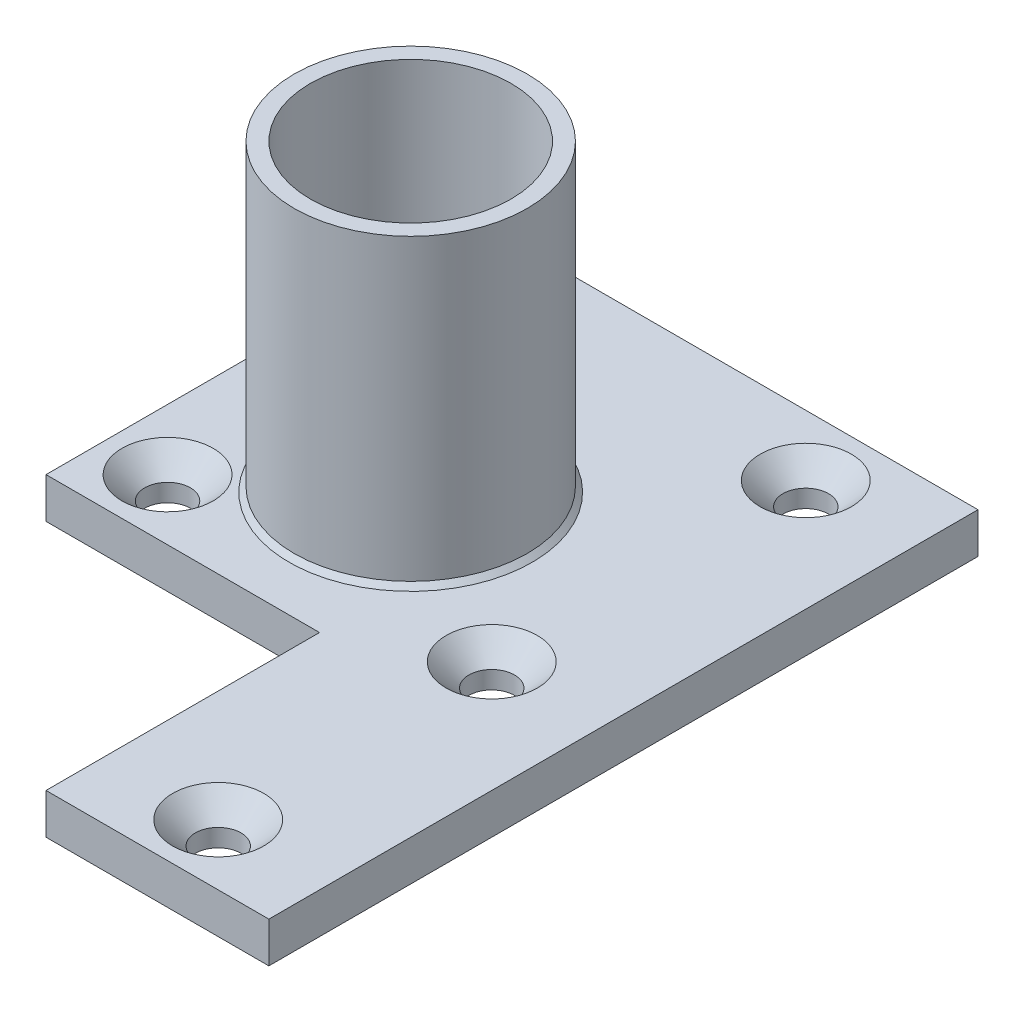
ISO-10303-21;
HEADER;
FILE_DESCRIPTION(('STEP AP214'),'2;1');
FILE_NAME('part.step','',(''),(''),'','','');
FILE_SCHEMA(('AUTOMOTIVE_DESIGN { 1 0 10303 214 1 1 1 1 }'));
ENDSEC;
DATA;
#1=APPLICATION_CONTEXT('core data for automotive mechanical design processes');
#2=APPLICATION_PROTOCOL_DEFINITION('international standard','automotive_design',2000,#1);
#3=PRODUCT_CONTEXT('',#1,'mechanical');
#4=PRODUCT('Part','Part','',(#3));
#5=PRODUCT_RELATED_PRODUCT_CATEGORY('part','',(#4));
#6=PRODUCT_DEFINITION_FORMATION('','',#4);
#7=PRODUCT_DEFINITION_CONTEXT('part definition',#1,'design');
#8=PRODUCT_DEFINITION('design','',#6,#7);
#9=PRODUCT_DEFINITION_SHAPE('','',#8);
#10=(LENGTH_UNIT() NAMED_UNIT(*) SI_UNIT(.MILLI.,.METRE.));
#11=(NAMED_UNIT(*) PLANE_ANGLE_UNIT() SI_UNIT($,.RADIAN.));
#12=(NAMED_UNIT(*) SI_UNIT($,.STERADIAN.) SOLID_ANGLE_UNIT());
#13=UNCERTAINTY_MEASURE_WITH_UNIT(LENGTH_MEASURE(1.E-05),#10,'distance_accuracy_value','');
#14=(GEOMETRIC_REPRESENTATION_CONTEXT(3) GLOBAL_UNCERTAINTY_ASSIGNED_CONTEXT((#13)) GLOBAL_UNIT_ASSIGNED_CONTEXT((#10,
#11,#12)) REPRESENTATION_CONTEXT('',''));
#15=CARTESIAN_POINT('',(0.,0.,0.));
#16=DIRECTION('',(0.,0.,1.));
#17=DIRECTION('',(1.,0.,0.));
#18=AXIS2_PLACEMENT_3D('',#15,#16,#17);
#19=CARTESIAN_POINT('',(-60.8412773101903,34.,-26.5));
#20=DIRECTION('',(0.,-1.,0.));
#21=DIRECTION('',(0.,0.,-1.));
#22=AXIS2_PLACEMENT_3D('',#19,#20,#21);
#23=PLANE('',#22);
#24=CARTESIAN_POINT('',(0.,34.,0.));
#25=DIRECTION('',(0.,-1.,0.));
#26=DIRECTION('',(0.,0.,-1.));
#27=AXIS2_PLACEMENT_3D('',#24,#25,#26);
#28=CIRCLE('',#27,11.5);
#29=CARTESIAN_POINT('',(0.,34.,-11.5));
#30=VERTEX_POINT('',#29);
#31=EDGE_CURVE('E20',#30,#30,#28,.T.);
#32=ORIENTED_EDGE('',*,*,#31,.F.);
#33=EDGE_LOOP('',(#32));
#34=FACE_BOUND('',#33,.T.);
#35=CARTESIAN_POINT('',(0.,34.,0.));
#36=DIRECTION('',(0.,1.,0.));
#37=DIRECTION('',(0.,0.,1.));
#38=AXIS2_PLACEMENT_3D('',#35,#36,#37);
#39=CIRCLE('',#38,9.9);
#40=CARTESIAN_POINT('',(0.,34.,9.9));
#41=VERTEX_POINT('',#40);
#42=EDGE_CURVE('E116',#41,#41,#39,.F.);
#43=ORIENTED_EDGE('',*,*,#42,.T.);
#44=EDGE_LOOP('',(#43));
#45=FACE_BOUND('',#44,.T.);
#46=ADVANCED_FACE('F17',(#34,#45),#23,.F.);
#47=CARTESIAN_POINT('',(0.,66.5269119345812,0.));
#48=DIRECTION('',(0.,-1.,0.));
#49=DIRECTION('',(0.,0.,-1.));
#50=AXIS2_PLACEMENT_3D('',#47,#48,#49);
#51=CYLINDRICAL_SURFACE('',#50,11.5);
#52=ORIENTED_EDGE('',*,*,#31,.T.);
#53=EDGE_LOOP('',(#52));
#54=FACE_BOUND('',#53,.T.);
#55=CARTESIAN_POINT('',(0.,4.5,0.));
#56=DIRECTION('',(0.,-1.,0.));
#57=DIRECTION('',(0.,0.,-1.));
#58=AXIS2_PLACEMENT_3D('',#55,#56,#57);
#59=CIRCLE('',#58,11.5);
#60=CARTESIAN_POINT('',(0.,4.5,-11.5));
#61=VERTEX_POINT('',#60);
#62=EDGE_CURVE('E112',#61,#61,#59,.T.);
#63=ORIENTED_EDGE('',*,*,#62,.F.);
#64=EDGE_LOOP('',(#63));
#65=FACE_BOUND('',#64,.T.);
#66=ADVANCED_FACE('F163',(#54,#65),#51,.T.);
#67=CARTESIAN_POINT('',(0.,-24.0014285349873,0.));
#68=DIRECTION('',(0.,1.,0.));
#69=DIRECTION('',(0.,0.,1.));
#70=AXIS2_PLACEMENT_3D('',#67,#68,#69);
#71=CYLINDRICAL_SURFACE('',#70,9.9);
#72=CARTESIAN_POINT('',(0.,4.,0.));
#73=DIRECTION('',(0.,1.,0.));
#74=DIRECTION('',(0.,0.,1.));
#75=AXIS2_PLACEMENT_3D('',#72,#73,#74);
#76=CIRCLE('',#75,9.9);
#77=CARTESIAN_POINT('',(0.,4.,9.9));
#78=VERTEX_POINT('',#77);
#79=EDGE_CURVE('E115',#78,#78,#76,.T.);
#80=ORIENTED_EDGE('',*,*,#79,.F.);
#81=EDGE_LOOP('',(#80));
#82=FACE_BOUND('',#81,.T.);
#83=ORIENTED_EDGE('',*,*,#42,.F.);
#84=EDGE_LOOP('',(#83));
#85=FACE_BOUND('',#84,.T.);
#86=ADVANCED_FACE('F171',(#82,#85),#71,.F.);
#87=CARTESIAN_POINT('',(0.,4.,0.));
#88=DIRECTION('',(0.,-1.,0.));
#89=DIRECTION('',(0.,0.,-1.));
#90=AXIS2_PLACEMENT_3D('',#87,#88,#89);
#91=CONICAL_SURFACE('',#90,12.,0.78539816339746);
#92=ORIENTED_EDGE('',*,*,#62,.T.);
#93=EDGE_LOOP('',(#92));
#94=FACE_BOUND('',#93,.T.);
#95=CARTESIAN_POINT('',(0.,4.,0.));
#96=DIRECTION('',(0.,-1.,0.));
#97=DIRECTION('',(0.,0.,-1.));
#98=AXIS2_PLACEMENT_3D('',#95,#96,#97);
#99=CIRCLE('',#98,12.);
#100=CARTESIAN_POINT('',(0.,4.,-12.));
#101=VERTEX_POINT('',#100);
#102=EDGE_CURVE('E153',#101,#101,#99,.T.);
#103=ORIENTED_EDGE('',*,*,#102,.F.);
#104=EDGE_LOOP('',(#103));
#105=FACE_BOUND('',#104,.T.);
#106=ADVANCED_FACE('F249',(#94,#105),#91,.T.);
#107=CARTESIAN_POINT('',(0.,4.,0.));
#108=DIRECTION('',(0.,1.,0.));
#109=DIRECTION('',(0.,0.,1.));
#110=AXIS2_PLACEMENT_3D('',#107,#108,#109);
#111=PLANE('',#110);
#112=ORIENTED_EDGE('',*,*,#79,.T.);
#113=EDGE_LOOP('',(#112));
#114=FACE_BOUND('',#113,.T.);
#115=CARTESIAN_POINT('',(0.,4.,0.));
#116=DIRECTION('',(0.,1.,0.));
#117=DIRECTION('',(0.,0.,1.));
#118=AXIS2_PLACEMENT_3D('',#115,#116,#117);
#119=CIRCLE('',#118,8.5);
#120=CARTESIAN_POINT('',(0.,4.,8.5));
#121=VERTEX_POINT('',#120);
#122=EDGE_CURVE('E111',#121,#121,#119,.F.);
#123=ORIENTED_EDGE('',*,*,#122,.T.);
#124=EDGE_LOOP('',(#123));
#125=FACE_BOUND('',#124,.T.);
#126=ADVANCED_FACE('F245',(#114,#125),#111,.T.);
#127=CARTESIAN_POINT('',(-13.5,4.0000000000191,-20.5));
#128=DIRECTION('',(0.,1.,0.));
#129=DIRECTION('',(0.,0.,1.));
#130=AXIS2_PLACEMENT_3D('',#127,#128,#129);
#131=CONICAL_SURFACE('',#130,4.49999999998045,0.785398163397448);
#132=CARTESIAN_POINT('',(-13.5,1.75,-20.5));
#133=DIRECTION('',(0.,1.,0.));
#134=DIRECTION('',(0.,0.,1.));
#135=AXIS2_PLACEMENT_3D('',#132,#133,#134);
#136=CIRCLE('',#135,2.25);
#137=CARTESIAN_POINT('',(-13.5,1.75,-18.25));
#138=VERTEX_POINT('',#137);
#139=EDGE_CURVE('E108',#138,#138,#136,.F.);
#140=ORIENTED_EDGE('',*,*,#139,.T.);
#141=EDGE_LOOP('',(#140));
#142=FACE_BOUND('',#141,.T.);
#143=CARTESIAN_POINT('',(-13.5,4.0000000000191,-20.5));
#144=DIRECTION('',(0.,1.,0.));
#145=DIRECTION('',(0.,0.,1.));
#146=AXIS2_PLACEMENT_3D('',#143,#144,#145);
#147=CIRCLE('',#146,4.49999999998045);
#148=CARTESIAN_POINT('',(-13.5,4.0000000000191,-16.0000000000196));
#149=VERTEX_POINT('',#148);
#150=EDGE_CURVE('E138',#149,#149,#147,.F.);
#151=ORIENTED_EDGE('',*,*,#150,.F.);
#152=EDGE_LOOP('',(#151));
#153=FACE_BOUND('',#152,.T.);
#154=ADVANCED_FACE('F241',(#142,#153),#131,.F.);
#155=CARTESIAN_POINT('',(18.5,4.0000000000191,-20.5));
#156=DIRECTION('',(0.,1.,0.));
#157=DIRECTION('',(0.,0.,1.));
#158=AXIS2_PLACEMENT_3D('',#155,#156,#157);
#159=CONICAL_SURFACE('',#158,4.49999999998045,0.785398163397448);
#160=CARTESIAN_POINT('',(18.5,1.75,-20.5));
#161=DIRECTION('',(0.,1.,0.));
#162=DIRECTION('',(0.,0.,1.));
#163=AXIS2_PLACEMENT_3D('',#160,#161,#162);
#164=CIRCLE('',#163,2.25);
#165=CARTESIAN_POINT('',(18.5,1.75,-18.25));
#166=VERTEX_POINT('',#165);
#167=EDGE_CURVE('E105',#166,#166,#164,.F.);
#168=ORIENTED_EDGE('',*,*,#167,.T.);
#169=EDGE_LOOP('',(#168));
#170=FACE_BOUND('',#169,.T.);
#171=CARTESIAN_POINT('',(18.5,4.0000000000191,-20.5));
#172=DIRECTION('',(0.,1.,0.));
#173=DIRECTION('',(0.,0.,1.));
#174=AXIS2_PLACEMENT_3D('',#171,#172,#173);
#175=CIRCLE('',#174,4.49999999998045);
#176=CARTESIAN_POINT('',(18.5,4.0000000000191,-16.0000000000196));
#177=VERTEX_POINT('',#176);
#178=EDGE_CURVE('E141',#177,#177,#175,.F.);
#179=ORIENTED_EDGE('',*,*,#178,.F.);
#180=EDGE_LOOP('',(#179));
#181=FACE_BOUND('',#180,.T.);
#182=ADVANCED_FACE('F237',(#170,#181),#159,.F.);
#183=CARTESIAN_POINT('',(18.5,4.0000000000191,10.5));
#184=DIRECTION('',(0.,1.,0.));
#185=DIRECTION('',(0.,0.,1.));
#186=AXIS2_PLACEMENT_3D('',#183,#184,#185);
#187=CONICAL_SURFACE('',#186,4.49999999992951,0.785398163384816);
#188=CARTESIAN_POINT('',(18.5,1.75,10.5));
#189=DIRECTION('',(0.,1.,0.));
#190=DIRECTION('',(0.,0.,1.));
#191=AXIS2_PLACEMENT_3D('',#188,#189,#190);
#192=CIRCLE('',#191,2.24999999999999);
#193=CARTESIAN_POINT('',(18.5,1.75,12.75));
#194=VERTEX_POINT('',#193);
#195=EDGE_CURVE('E102',#194,#194,#192,.F.);
#196=ORIENTED_EDGE('',*,*,#195,.T.);
#197=EDGE_LOOP('',(#196));
#198=FACE_BOUND('',#197,.T.);
#199=CARTESIAN_POINT('',(18.5,4.0000000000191,10.5));
#200=DIRECTION('',(0.,1.,0.));
#201=DIRECTION('',(0.,0.,1.));
#202=AXIS2_PLACEMENT_3D('',#199,#200,#201);
#203=CIRCLE('',#202,4.49999999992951);
#204=CARTESIAN_POINT('',(18.5,4.0000000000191,14.9999999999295));
#205=VERTEX_POINT('',#204);
#206=EDGE_CURVE('E144',#205,#205,#203,.F.);
#207=ORIENTED_EDGE('',*,*,#206,.F.);
#208=EDGE_LOOP('',(#207));
#209=FACE_BOUND('',#208,.T.);
#210=ADVANCED_FACE('F233',(#198,#209),#187,.F.);
#211=CARTESIAN_POINT('',(18.5,3.99999999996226,37.5));
#212=DIRECTION('',(0.,1.,0.));
#213=DIRECTION('',(0.,0.,1.));
#214=AXIS2_PLACEMENT_3D('',#211,#212,#213);
#215=CONICAL_SURFACE('',#214,4.49999999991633,0.785398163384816);
#216=CARTESIAN_POINT('',(18.5,1.75,37.5));
#217=DIRECTION('',(0.,1.,0.));
#218=DIRECTION('',(0.,0.,1.));
#219=AXIS2_PLACEMENT_3D('',#216,#217,#218);
#220=CIRCLE('',#219,2.25);
#221=CARTESIAN_POINT('',(18.5,1.75,39.75));
#222=VERTEX_POINT('',#221);
#223=EDGE_CURVE('E99',#222,#222,#220,.F.);
#224=ORIENTED_EDGE('',*,*,#223,.T.);
#225=EDGE_LOOP('',(#224));
#226=FACE_BOUND('',#225,.T.);
#227=CARTESIAN_POINT('',(18.5,4.0000000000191,37.5));
#228=DIRECTION('',(0.,1.,0.));
#229=DIRECTION('',(0.,0.,1.));
#230=AXIS2_PLACEMENT_3D('',#227,#228,#229);
#231=CIRCLE('',#230,4.49999999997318);
#232=CARTESIAN_POINT('',(18.5,4.0000000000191,41.9999999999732));
#233=VERTEX_POINT('',#232);
#234=EDGE_CURVE('E147',#233,#233,#231,.F.);
#235=ORIENTED_EDGE('',*,*,#234,.F.);
#236=EDGE_LOOP('',(#235));
#237=FACE_BOUND('',#236,.T.);
#238=ADVANCED_FACE('F229',(#226,#237),#215,.F.);
#239=CARTESIAN_POINT('',(-13.5,4.0000000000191,10.5));
#240=DIRECTION('',(0.,1.,0.));
#241=DIRECTION('',(0.,0.,1.));
#242=AXIS2_PLACEMENT_3D('',#239,#240,#241);
#243=CONICAL_SURFACE('',#242,4.49999999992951,0.785398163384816);
#244=CARTESIAN_POINT('',(-13.5,1.75,10.5));
#245=DIRECTION('',(0.,1.,0.));
#246=DIRECTION('',(0.,0.,1.));
#247=AXIS2_PLACEMENT_3D('',#244,#245,#246);
#248=CIRCLE('',#247,2.24999999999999);
#249=CARTESIAN_POINT('',(-13.5,1.75,12.75));
#250=VERTEX_POINT('',#249);
#251=EDGE_CURVE('E83',#250,#250,#248,.F.);
#252=ORIENTED_EDGE('',*,*,#251,.T.);
#253=EDGE_LOOP('',(#252));
#254=FACE_BOUND('',#253,.T.);
#255=CARTESIAN_POINT('',(-13.5,4.0000000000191,10.5));
#256=DIRECTION('',(0.,1.,0.));
#257=DIRECTION('',(0.,0.,1.));
#258=AXIS2_PLACEMENT_3D('',#255,#256,#257);
#259=CIRCLE('',#258,4.49999999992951);
#260=CARTESIAN_POINT('',(-13.5,4.0000000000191,14.9999999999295));
#261=VERTEX_POINT('',#260);
#262=EDGE_CURVE('E150',#261,#261,#259,.F.);
#263=ORIENTED_EDGE('',*,*,#262,.F.);
#264=EDGE_LOOP('',(#263));
#265=FACE_BOUND('',#264,.T.);
#266=ADVANCED_FACE('F225',(#254,#265),#243,.F.);
#267=CARTESIAN_POINT('',(0.,4.,0.));
#268=DIRECTION('',(0.,1.,0.));
#269=DIRECTION('',(0.,0.,1.));
#270=AXIS2_PLACEMENT_3D('',#267,#268,#269);
#271=PLANE('',#270);
#272=ORIENTED_EDGE('',*,*,#150,.T.);
#273=EDGE_LOOP('',(#272));
#274=FACE_BOUND('',#273,.T.);
#275=ORIENTED_EDGE('',*,*,#178,.T.);
#276=EDGE_LOOP('',(#275));
#277=FACE_BOUND('',#276,.T.);
#278=ORIENTED_EDGE('',*,*,#206,.T.);
#279=EDGE_LOOP('',(#278));
#280=FACE_BOUND('',#279,.T.);
#281=ORIENTED_EDGE('',*,*,#234,.T.);
#282=EDGE_LOOP('',(#281));
#283=FACE_BOUND('',#282,.T.);
#284=ORIENTED_EDGE('',*,*,#262,.T.);
#285=EDGE_LOOP('',(#284));
#286=FACE_BOUND('',#285,.T.);
#287=DIRECTION('',(-1.,0.,0.));
#288=VECTOR('',#287,1.);
#289=CARTESIAN_POINT('',(-19.5,4.,16.5));
#290=LINE('',#289,#288);
#291=CARTESIAN_POINT('',(-19.5,4.,16.5));
#292=VERTEX_POINT('',#291);
#293=CARTESIAN_POINT('',(7.5,4.,16.5));
#294=VERTEX_POINT('',#293);
#295=EDGE_CURVE('E74',#292,#294,#290,.F.);
#296=ORIENTED_EDGE('',*,*,#295,.T.);
#297=DIRECTION('',(0.,0.,-1.));
#298=VECTOR('',#297,1.);
#299=CARTESIAN_POINT('',(7.5,4.,43.5));
#300=LINE('',#299,#298);
#301=CARTESIAN_POINT('',(7.5,4.,43.5));
#302=VERTEX_POINT('',#301);
#303=EDGE_CURVE('E65',#294,#302,#300,.F.);
#304=ORIENTED_EDGE('',*,*,#303,.T.);
#305=DIRECTION('',(-1.,0.,0.));
#306=VECTOR('',#305,1.);
#307=CARTESIAN_POINT('',(0.,4.,43.5));
#308=LINE('',#307,#306);
#309=CARTESIAN_POINT('',(29.5,4.,43.5));
#310=VERTEX_POINT('',#309);
#311=EDGE_CURVE('E468',#302,#310,#308,.F.);
#312=ORIENTED_EDGE('',*,*,#311,.T.);
#313=DIRECTION('',(0.,0.,-1.));
#314=VECTOR('',#313,1.);
#315=CARTESIAN_POINT('',(29.5,4.,0.));
#316=LINE('',#315,#314);
#317=CARTESIAN_POINT('',(29.5,4.,-26.5));
#318=VERTEX_POINT('',#317);
#319=EDGE_CURVE('E463',#318,#310,#316,.F.);
#320=ORIENTED_EDGE('',*,*,#319,.F.);
#321=DIRECTION('',(-1.,0.,0.));
#322=VECTOR('',#321,1.);
#323=CARTESIAN_POINT('',(0.,4.,-26.5));
#324=LINE('',#323,#322);
#325=CARTESIAN_POINT('',(-19.5,4.,-26.5));
#326=VERTEX_POINT('',#325);
#327=EDGE_CURVE('E77',#326,#318,#324,.F.);
#328=ORIENTED_EDGE('',*,*,#327,.F.);
#329=DIRECTION('',(0.,0.,-1.));
#330=VECTOR('',#329,1.);
#331=CARTESIAN_POINT('',(-19.5,4.,-16.5));
#332=LINE('',#331,#330);
#333=EDGE_CURVE('E70',#326,#292,#332,.F.);
#334=ORIENTED_EDGE('',*,*,#333,.T.);
#335=EDGE_LOOP('',(#296,#304,#312,#320,#328,#334));
#336=FACE_BOUND('',#335,.T.);
#337=ORIENTED_EDGE('',*,*,#102,.T.);
#338=EDGE_LOOP('',(#337));
#339=FACE_BOUND('',#338,.T.);
#340=ADVANCED_FACE('F72',(#274,#277,#280,#283,#286,#336,#339),#271,.T.);
#341=CARTESIAN_POINT('',(0.,-4.99999999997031E-05,0.));
#342=DIRECTION('',(0.,1.,0.));
#343=DIRECTION('',(0.,0.,1.));
#344=AXIS2_PLACEMENT_3D('',#341,#342,#343);
#345=CYLINDRICAL_SURFACE('',#344,8.5);
#346=CARTESIAN_POINT('',(0.,0.,0.));
#347=DIRECTION('',(0.,1.,0.));
#348=DIRECTION('',(0.,0.,1.));
#349=AXIS2_PLACEMENT_3D('',#346,#347,#348);
#350=CIRCLE('',#349,8.5);
#351=CARTESIAN_POINT('',(0.,0.,8.5));
#352=VERTEX_POINT('',#351);
#353=EDGE_CURVE('E132',#352,#352,#350,.F.);
#354=ORIENTED_EDGE('',*,*,#353,.T.);
#355=EDGE_LOOP('',(#354));
#356=FACE_BOUND('',#355,.T.);
#357=ORIENTED_EDGE('',*,*,#122,.F.);
#358=EDGE_LOOP('',(#357));
#359=FACE_BOUND('',#358,.T.);
#360=ADVANCED_FACE('F218',(#356,#359),#345,.F.);
#361=CARTESIAN_POINT('',(-13.5,4.,-20.5));
#362=DIRECTION('',(0.,1.,0.));
#363=DIRECTION('',(0.,0.,1.));
#364=AXIS2_PLACEMENT_3D('',#361,#362,#363);
#365=CYLINDRICAL_SURFACE('',#364,2.25);
#366=CARTESIAN_POINT('',(-13.5,0.,-20.5));
#367=DIRECTION('',(0.,1.,0.));
#368=DIRECTION('',(0.,0.,1.));
#369=AXIS2_PLACEMENT_3D('',#366,#367,#368);
#370=CIRCLE('',#369,2.25);
#371=CARTESIAN_POINT('',(-13.5,0.,-18.25));
#372=VERTEX_POINT('',#371);
#373=EDGE_CURVE('E129',#372,#372,#370,.F.);
#374=ORIENTED_EDGE('',*,*,#373,.T.);
#375=EDGE_LOOP('',(#374));
#376=FACE_BOUND('',#375,.T.);
#377=ORIENTED_EDGE('',*,*,#139,.F.);
#378=EDGE_LOOP('',(#377));
#379=FACE_BOUND('',#378,.T.);
#380=ADVANCED_FACE('F214',(#376,#379),#365,.F.);
#381=CARTESIAN_POINT('',(18.5,4.,-20.5));
#382=DIRECTION('',(0.,1.,0.));
#383=DIRECTION('',(0.,0.,1.));
#384=AXIS2_PLACEMENT_3D('',#381,#382,#383);
#385=CYLINDRICAL_SURFACE('',#384,2.25);
#386=CARTESIAN_POINT('',(18.5,0.,-20.5));
#387=DIRECTION('',(0.,1.,0.));
#388=DIRECTION('',(0.,0.,1.));
#389=AXIS2_PLACEMENT_3D('',#386,#387,#388);
#390=CIRCLE('',#389,2.25);
#391=CARTESIAN_POINT('',(18.5,0.,-18.25));
#392=VERTEX_POINT('',#391);
#393=EDGE_CURVE('E126',#392,#392,#390,.F.);
#394=ORIENTED_EDGE('',*,*,#393,.T.);
#395=EDGE_LOOP('',(#394));
#396=FACE_BOUND('',#395,.T.);
#397=ORIENTED_EDGE('',*,*,#167,.F.);
#398=EDGE_LOOP('',(#397));
#399=FACE_BOUND('',#398,.T.);
#400=ADVANCED_FACE('F210',(#396,#399),#385,.F.);
#401=CARTESIAN_POINT('',(18.5,4.,10.5));
#402=DIRECTION('',(0.,1.,0.));
#403=DIRECTION('',(0.,0.,1.));
#404=AXIS2_PLACEMENT_3D('',#401,#402,#403);
#405=CYLINDRICAL_SURFACE('',#404,2.24999999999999);
#406=CARTESIAN_POINT('',(18.5,0.,10.5));
#407=DIRECTION('',(0.,1.,0.));
#408=DIRECTION('',(0.,0.,1.));
#409=AXIS2_PLACEMENT_3D('',#406,#407,#408);
#410=CIRCLE('',#409,2.24999999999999);
#411=CARTESIAN_POINT('',(18.5,0.,12.75));
#412=VERTEX_POINT('',#411);
#413=EDGE_CURVE('E123',#412,#412,#410,.F.);
#414=ORIENTED_EDGE('',*,*,#413,.T.);
#415=EDGE_LOOP('',(#414));
#416=FACE_BOUND('',#415,.T.);
#417=ORIENTED_EDGE('',*,*,#195,.F.);
#418=EDGE_LOOP('',(#417));
#419=FACE_BOUND('',#418,.T.);
#420=ADVANCED_FACE('F206',(#416,#419),#405,.F.);
#421=CARTESIAN_POINT('',(18.5,4.,37.5));
#422=DIRECTION('',(0.,1.,0.));
#423=DIRECTION('',(0.,0.,1.));
#424=AXIS2_PLACEMENT_3D('',#421,#422,#423);
#425=CYLINDRICAL_SURFACE('',#424,2.25);
#426=CARTESIAN_POINT('',(18.5,0.,37.5));
#427=DIRECTION('',(0.,1.,0.));
#428=DIRECTION('',(0.,0.,1.));
#429=AXIS2_PLACEMENT_3D('',#426,#427,#428);
#430=CIRCLE('',#429,2.25);
#431=CARTESIAN_POINT('',(18.5,0.,39.75));
#432=VERTEX_POINT('',#431);
#433=EDGE_CURVE('E120',#432,#432,#430,.F.);
#434=ORIENTED_EDGE('',*,*,#433,.T.);
#435=EDGE_LOOP('',(#434));
#436=FACE_BOUND('',#435,.T.);
#437=ORIENTED_EDGE('',*,*,#223,.F.);
#438=EDGE_LOOP('',(#437));
#439=FACE_BOUND('',#438,.T.);
#440=ADVANCED_FACE('F202',(#436,#439),#425,.F.);
#441=CARTESIAN_POINT('',(-13.5,4.,10.5));
#442=DIRECTION('',(0.,1.,0.));
#443=DIRECTION('',(0.,0.,1.));
#444=AXIS2_PLACEMENT_3D('',#441,#442,#443);
#445=CYLINDRICAL_SURFACE('',#444,2.24999999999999);
#446=CARTESIAN_POINT('',(-13.5,0.,10.5));
#447=DIRECTION('',(0.,1.,0.));
#448=DIRECTION('',(0.,0.,1.));
#449=AXIS2_PLACEMENT_3D('',#446,#447,#448);
#450=CIRCLE('',#449,2.24999999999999);
#451=CARTESIAN_POINT('',(-13.5,0.,12.75));
#452=VERTEX_POINT('',#451);
#453=EDGE_CURVE('E117',#452,#452,#450,.F.);
#454=ORIENTED_EDGE('',*,*,#453,.T.);
#455=EDGE_LOOP('',(#454));
#456=FACE_BOUND('',#455,.T.);
#457=ORIENTED_EDGE('',*,*,#251,.F.);
#458=EDGE_LOOP('',(#457));
#459=FACE_BOUND('',#458,.T.);
#460=ADVANCED_FACE('F199',(#456,#459),#445,.F.);
#461=CARTESIAN_POINT('',(-19.5,4.,-16.5));
#462=DIRECTION('',(1.,0.,0.));
#463=DIRECTION('',(0.,0.,-1.));
#464=AXIS2_PLACEMENT_3D('',#461,#462,#463);
#465=PLANE('',#464);
#466=DIRECTION('',(0.,1.,0.));
#467=VECTOR('',#466,1.);
#468=CARTESIAN_POINT('',(-19.5,4.,16.5));
#469=LINE('',#468,#467);
#470=CARTESIAN_POINT('',(-19.5,0.,16.5));
#471=VERTEX_POINT('',#470);
#472=EDGE_CURVE('E82',#471,#292,#469,.T.);
#473=ORIENTED_EDGE('',*,*,#472,.T.);
#474=ORIENTED_EDGE('',*,*,#333,.F.);
#475=DIRECTION('',(0.,1.,0.));
#476=VECTOR('',#475,1.);
#477=CARTESIAN_POINT('',(-19.5,0.,-26.5));
#478=LINE('',#477,#476);
#479=CARTESIAN_POINT('',(-19.5,0.,-26.5));
#480=VERTEX_POINT('',#479);
#481=EDGE_CURVE('E135',#480,#326,#478,.T.);
#482=ORIENTED_EDGE('',*,*,#481,.F.);
#483=DIRECTION('',(0.,0.,1.));
#484=VECTOR('',#483,1.);
#485=CARTESIAN_POINT('',(-19.5,0.,0.));
#486=LINE('',#485,#484);
#487=EDGE_CURVE('E93',#480,#471,#486,.T.);
#488=ORIENTED_EDGE('',*,*,#487,.T.);
#489=EDGE_LOOP('',(#473,#474,#482,#488));
#490=FACE_BOUND('',#489,.T.);
#491=ADVANCED_FACE('F92',(#490),#465,.F.);
#492=CARTESIAN_POINT('',(-19.5,4.,16.5));
#493=DIRECTION('',(0.,0.,-1.));
#494=DIRECTION('',(-1.,0.,0.));
#495=AXIS2_PLACEMENT_3D('',#492,#493,#494);
#496=PLANE('',#495);
#497=ORIENTED_EDGE('',*,*,#295,.F.);
#498=ORIENTED_EDGE('',*,*,#472,.F.);
#499=DIRECTION('',(1.,0.,0.));
#500=VECTOR('',#499,1.);
#501=CARTESIAN_POINT('',(0.,0.,16.5));
#502=LINE('',#501,#500);
#503=CARTESIAN_POINT('',(7.5,0.,16.5));
#504=VERTEX_POINT('',#503);
#505=EDGE_CURVE('E452',#471,#504,#502,.T.);
#506=ORIENTED_EDGE('',*,*,#505,.T.);
#507=DIRECTION('',(0.,1.,0.));
#508=VECTOR('',#507,1.);
#509=CARTESIAN_POINT('',(7.5,4.,16.5));
#510=LINE('',#509,#508);
#511=EDGE_CURVE('E89',#504,#294,#510,.T.);
#512=ORIENTED_EDGE('',*,*,#511,.T.);
#513=EDGE_LOOP('',(#497,#498,#506,#512));
#514=FACE_BOUND('',#513,.T.);
#515=ADVANCED_FACE('F86',(#514),#496,.F.);
#516=CARTESIAN_POINT('',(7.5,4.,43.5));
#517=DIRECTION('',(1.,0.,0.));
#518=DIRECTION('',(0.,0.,-1.));
#519=AXIS2_PLACEMENT_3D('',#516,#517,#518);
#520=PLANE('',#519);
#521=DIRECTION('',(0.,0.,1.));
#522=VECTOR('',#521,1.);
#523=CARTESIAN_POINT('',(7.5,0.,0.));
#524=LINE('',#523,#522);
#525=CARTESIAN_POINT('',(7.5,0.,43.5));
#526=VERTEX_POINT('',#525);
#527=EDGE_CURVE('E448',#504,#526,#524,.T.);
#528=ORIENTED_EDGE('',*,*,#527,.T.);
#529=DIRECTION('',(0.,1.,0.));
#530=VECTOR('',#529,1.);
#531=CARTESIAN_POINT('',(7.5,0.,43.5));
#532=LINE('',#531,#530);
#533=EDGE_CURVE('E449',#526,#302,#532,.T.);
#534=ORIENTED_EDGE('',*,*,#533,.T.);
#535=ORIENTED_EDGE('',*,*,#303,.F.);
#536=ORIENTED_EDGE('',*,*,#511,.F.);
#537=EDGE_LOOP('',(#528,#534,#535,#536));
#538=FACE_BOUND('',#537,.T.);
#539=ADVANCED_FACE('F191',(#538),#520,.F.);
#540=CARTESIAN_POINT('',(0.,0.,43.5));
#541=DIRECTION('',(0.,0.,-1.));
#542=DIRECTION('',(-1.,0.,0.));
#543=AXIS2_PLACEMENT_3D('',#540,#541,#542);
#544=PLANE('',#543);
#545=DIRECTION('',(0.,1.,0.));
#546=VECTOR('',#545,1.);
#547=CARTESIAN_POINT('',(29.5,0.,43.5));
#548=LINE('',#547,#546);
#549=CARTESIAN_POINT('',(29.5,0.,43.5));
#550=VERTEX_POINT('',#549);
#551=EDGE_CURVE('E466',#310,#550,#548,.F.);
#552=ORIENTED_EDGE('',*,*,#551,.F.);
#553=ORIENTED_EDGE('',*,*,#311,.F.);
#554=ORIENTED_EDGE('',*,*,#533,.F.);
#555=DIRECTION('',(1.,0.,0.));
#556=VECTOR('',#555,1.);
#557=CARTESIAN_POINT('',(0.,0.,43.5));
#558=LINE('',#557,#556);
#559=EDGE_CURVE('E451',#526,#550,#558,.T.);
#560=ORIENTED_EDGE('',*,*,#559,.T.);
#561=EDGE_LOOP('',(#552,#553,#554,#560));
#562=FACE_BOUND('',#561,.T.);
#563=ADVANCED_FACE('F187',(#562),#544,.F.);
#564=CARTESIAN_POINT('',(29.5,0.,0.));
#565=DIRECTION('',(1.,0.,0.));
#566=DIRECTION('',(0.,0.,-1.));
#567=AXIS2_PLACEMENT_3D('',#564,#565,#566);
#568=PLANE('',#567);
#569=DIRECTION('',(0.,1.,0.));
#570=VECTOR('',#569,1.);
#571=CARTESIAN_POINT('',(29.5,0.,-26.5));
#572=LINE('',#571,#570);
#573=CARTESIAN_POINT('',(29.5,0.,-26.5));
#574=VERTEX_POINT('',#573);
#575=EDGE_CURVE('E34',#318,#574,#572,.F.);
#576=ORIENTED_EDGE('',*,*,#575,.F.);
#577=ORIENTED_EDGE('',*,*,#319,.T.);
#578=ORIENTED_EDGE('',*,*,#551,.T.);
#579=DIRECTION('',(0.,0.,1.));
#580=VECTOR('',#579,1.);
#581=CARTESIAN_POINT('',(29.5,0.,0.));
#582=LINE('',#581,#580);
#583=EDGE_CURVE('E26',#550,#574,#582,.F.);
#584=ORIENTED_EDGE('',*,*,#583,.T.);
#585=EDGE_LOOP('',(#576,#577,#578,#584));
#586=FACE_BOUND('',#585,.T.);
#587=ADVANCED_FACE('F180',(#586),#568,.T.);
#588=CARTESIAN_POINT('',(0.,0.,-26.5));
#589=DIRECTION('',(0.,0.,-1.));
#590=DIRECTION('',(-1.,0.,0.));
#591=AXIS2_PLACEMENT_3D('',#588,#589,#590);
#592=PLANE('',#591);
#593=DIRECTION('',(1.,0.,0.));
#594=VECTOR('',#593,1.);
#595=CARTESIAN_POINT('',(0.,0.,-26.5));
#596=LINE('',#595,#594);
#597=EDGE_CURVE('E11',#574,#480,#596,.F.);
#598=ORIENTED_EDGE('',*,*,#597,.T.);
#599=ORIENTED_EDGE('',*,*,#481,.T.);
#600=ORIENTED_EDGE('',*,*,#327,.T.);
#601=ORIENTED_EDGE('',*,*,#575,.T.);
#602=EDGE_LOOP('',(#598,#599,#600,#601));
#603=FACE_BOUND('',#602,.T.);
#604=ADVANCED_FACE('F174',(#603),#592,.T.);
#605=CARTESIAN_POINT('',(0.,0.,0.));
#606=DIRECTION('',(0.,1.,0.));
#607=DIRECTION('',(0.,0.,1.));
#608=AXIS2_PLACEMENT_3D('',#605,#606,#607);
#609=PLANE('',#608);
#610=ORIENTED_EDGE('',*,*,#583,.F.);
#611=ORIENTED_EDGE('',*,*,#559,.F.);
#612=ORIENTED_EDGE('',*,*,#527,.F.);
#613=ORIENTED_EDGE('',*,*,#505,.F.);
#614=ORIENTED_EDGE('',*,*,#487,.F.);
#615=ORIENTED_EDGE('',*,*,#597,.F.);
#616=EDGE_LOOP('',(#610,#611,#612,#613,#614,#615));
#617=FACE_BOUND('',#616,.T.);
#618=ORIENTED_EDGE('',*,*,#453,.F.);
#619=EDGE_LOOP('',(#618));
#620=FACE_BOUND('',#619,.T.);
#621=ORIENTED_EDGE('',*,*,#433,.F.);
#622=EDGE_LOOP('',(#621));
#623=FACE_BOUND('',#622,.T.);
#624=ORIENTED_EDGE('',*,*,#413,.F.);
#625=EDGE_LOOP('',(#624));
#626=FACE_BOUND('',#625,.T.);
#627=ORIENTED_EDGE('',*,*,#393,.F.);
#628=EDGE_LOOP('',(#627));
#629=FACE_BOUND('',#628,.T.);
#630=ORIENTED_EDGE('',*,*,#373,.F.);
#631=EDGE_LOOP('',(#630));
#632=FACE_BOUND('',#631,.T.);
#633=ORIENTED_EDGE('',*,*,#353,.F.);
#634=EDGE_LOOP('',(#633));
#635=FACE_BOUND('',#634,.T.);
#636=ADVANCED_FACE('F172',(#617,#620,#623,#626,#629,#632,#635),#609,.F.);
#637=CLOSED_SHELL('',(#46,#66,#86,#106,#126,#154,#182,#210,#238,#266,#340,#360,#380,#400,#420,
#440,#460,#491,#515,#539,#563,#587,#604,#636));
#638=MANIFOLD_SOLID_BREP('B1',#637);
#639=ADVANCED_BREP_SHAPE_REPRESENTATION('',(#18,#638),#14);
#640=SHAPE_DEFINITION_REPRESENTATION(#9,#639);
ENDSEC;
END-ISO-10303-21;
